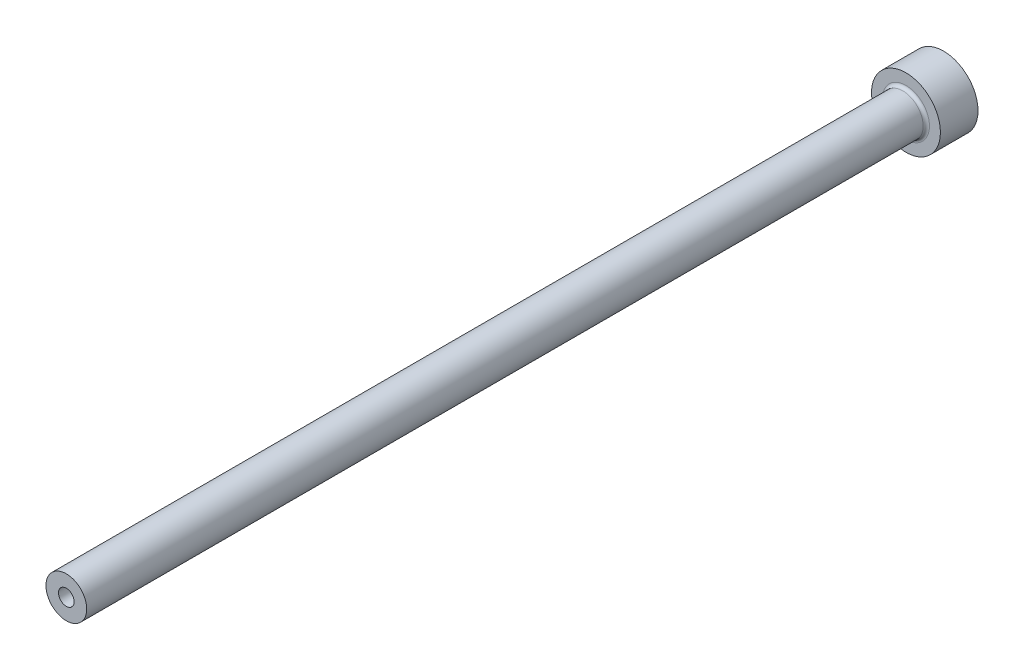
ISO-10303-21;
HEADER;
FILE_DESCRIPTION(('STEP AP214'),'2;1');
FILE_NAME('part.step','',(''),(''),'','','');
FILE_SCHEMA(('AUTOMOTIVE_DESIGN { 1 0 10303 214 1 1 1 1 }'));
ENDSEC;
DATA;
#1=APPLICATION_CONTEXT('core data for automotive mechanical design processes');
#2=APPLICATION_PROTOCOL_DEFINITION('international standard','automotive_design',2000,#1);
#3=PRODUCT_CONTEXT('',#1,'mechanical');
#4=PRODUCT('Part','Part','',(#3));
#5=PRODUCT_RELATED_PRODUCT_CATEGORY('part','',(#4));
#6=PRODUCT_DEFINITION_FORMATION('','',#4);
#7=PRODUCT_DEFINITION_CONTEXT('part definition',#1,'design');
#8=PRODUCT_DEFINITION('design','',#6,#7);
#9=PRODUCT_DEFINITION_SHAPE('','',#8);
#10=(LENGTH_UNIT() NAMED_UNIT(*) SI_UNIT(.MILLI.,.METRE.));
#11=(NAMED_UNIT(*) PLANE_ANGLE_UNIT() SI_UNIT($,.RADIAN.));
#12=(NAMED_UNIT(*) SI_UNIT($,.STERADIAN.) SOLID_ANGLE_UNIT());
#13=UNCERTAINTY_MEASURE_WITH_UNIT(LENGTH_MEASURE(1.E-05),#10,'distance_accuracy_value','');
#14=(GEOMETRIC_REPRESENTATION_CONTEXT(3) GLOBAL_UNCERTAINTY_ASSIGNED_CONTEXT((#13)) GLOBAL_UNIT_ASSIGNED_CONTEXT((#10,
#11,#12)) REPRESENTATION_CONTEXT('',''));
#15=CARTESIAN_POINT('',(0.,0.,0.));
#16=DIRECTION('',(0.,0.,1.));
#17=DIRECTION('',(1.,0.,0.));
#18=AXIS2_PLACEMENT_3D('',#15,#16,#17);
#19=CARTESIAN_POINT('',(0.,0.,140.));
#20=DIRECTION('',(0.,0.,-1.));
#21=DIRECTION('',(-1.,0.,0.));
#22=AXIS2_PLACEMENT_3D('',#19,#20,#21);
#23=PLANE('',#22);
#24=CARTESIAN_POINT('',(0.,0.,140.));
#25=DIRECTION('',(0.,0.,1.));
#26=DIRECTION('',(1.,0.,0.));
#27=AXIS2_PLACEMENT_3D('',#24,#25,#26);
#28=CIRCLE('',#27,1.24999999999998);
#29=CARTESIAN_POINT('',(1.24999999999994,0.,140.));
#30=VERTEX_POINT('',#29);
#31=EDGE_CURVE('E63',#30,#30,#28,.T.);
#32=ORIENTED_EDGE('',*,*,#31,.F.);
#33=EDGE_LOOP('',(#32));
#34=FACE_BOUND('',#33,.T.);
#35=CARTESIAN_POINT('',(0.,0.,140.));
#36=DIRECTION('',(0.,0.,1.));
#37=DIRECTION('',(1.,0.,0.));
#38=AXIS2_PLACEMENT_3D('',#35,#36,#37);
#39=CIRCLE('',#38,3.24999999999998);
#40=CARTESIAN_POINT('',(3.24999999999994,0.,140.));
#41=VERTEX_POINT('',#40);
#42=EDGE_CURVE('E54',#41,#41,#39,.T.);
#43=ORIENTED_EDGE('',*,*,#42,.T.);
#44=EDGE_LOOP('',(#43));
#45=FACE_BOUND('',#44,.T.);
#46=ADVANCED_FACE('F34',(#34,#45),#23,.F.);
#47=CARTESIAN_POINT('',(0.,0.,140.));
#48=DIRECTION('',(0.,0.,1.));
#49=DIRECTION('',(1.,0.,0.));
#50=AXIS2_PLACEMENT_3D('',#47,#48,#49);
#51=CYLINDRICAL_SURFACE('',#50,3.24999999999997);
#52=CARTESIAN_POINT('',(0.,0.,6.50000000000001));
#53=DIRECTION('',(0.,0.,1.));
#54=DIRECTION('',(1.,0.,0.));
#55=AXIS2_PLACEMENT_3D('',#52,#53,#54);
#56=CIRCLE('',#55,3.24999999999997);
#57=CARTESIAN_POINT('',(3.24999999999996,0.,6.50000000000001));
#58=VERTEX_POINT('',#57);
#59=EDGE_CURVE('E49',#58,#58,#56,.T.);
#60=ORIENTED_EDGE('',*,*,#59,.T.);
#61=EDGE_LOOP('',(#60));
#62=FACE_BOUND('',#61,.T.);
#63=ORIENTED_EDGE('',*,*,#42,.F.);
#64=EDGE_LOOP('',(#63));
#65=FACE_BOUND('',#64,.T.);
#66=ADVANCED_FACE('F92',(#62,#65),#51,.T.);
#67=CARTESIAN_POINT('',(0.,0.,6.));
#68=DIRECTION('',(0.,0.,1.));
#69=DIRECTION('',(1.,0.,0.));
#70=AXIS2_PLACEMENT_3D('',#67,#68,#69);
#71=PLANE('',#70);
#72=CARTESIAN_POINT('',(0.,0.,6.));
#73=DIRECTION('',(0.,0.,1.));
#74=DIRECTION('',(1.,0.,0.));
#75=AXIS2_PLACEMENT_3D('',#72,#73,#74);
#76=CIRCLE('',#75,3.74999999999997);
#77=CARTESIAN_POINT('',(3.74999999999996,0.,6.));
#78=VERTEX_POINT('',#77);
#79=EDGE_CURVE('E45',#78,#78,#76,.F.);
#80=ORIENTED_EDGE('',*,*,#79,.T.);
#81=EDGE_LOOP('',(#80));
#82=FACE_BOUND('',#81,.T.);
#83=CARTESIAN_POINT('',(0.,0.,6.00000000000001));
#84=DIRECTION('',(0.,0.,1.));
#85=DIRECTION('',(1.,0.,0.));
#86=AXIS2_PLACEMENT_3D('',#83,#84,#85);
#87=CIRCLE('',#86,5.49999999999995);
#88=CARTESIAN_POINT('',(5.49999999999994,0.,6.00000000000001));
#89=VERTEX_POINT('',#88);
#90=EDGE_CURVE('E57',#89,#89,#87,.T.);
#91=ORIENTED_EDGE('',*,*,#90,.T.);
#92=EDGE_LOOP('',(#91));
#93=FACE_BOUND('',#92,.T.);
#94=ADVANCED_FACE('F98',(#82,#93),#71,.T.);
#95=CARTESIAN_POINT('',(0.,0.,140.));
#96=DIRECTION('',(0.,0.,1.));
#97=DIRECTION('',(1.,0.,0.));
#98=AXIS2_PLACEMENT_3D('',#95,#96,#97);
#99=CYLINDRICAL_SURFACE('',#98,5.49999999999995);
#100=ORIENTED_EDGE('',*,*,#90,.F.);
#101=EDGE_LOOP('',(#100));
#102=FACE_BOUND('',#101,.T.);
#103=CARTESIAN_POINT('',(0.,0.,0.));
#104=DIRECTION('',(0.,0.,1.));
#105=DIRECTION('',(1.,0.,0.));
#106=AXIS2_PLACEMENT_3D('',#103,#104,#105);
#107=CIRCLE('',#106,5.49999999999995);
#108=CARTESIAN_POINT('',(5.49999999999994,0.,0.));
#109=VERTEX_POINT('',#108);
#110=EDGE_CURVE('E60',#109,#109,#107,.T.);
#111=ORIENTED_EDGE('',*,*,#110,.T.);
#112=EDGE_LOOP('',(#111));
#113=FACE_BOUND('',#112,.T.);
#114=ADVANCED_FACE('F89',(#102,#113),#99,.T.);
#115=CARTESIAN_POINT('',(0.,0.,0.));
#116=DIRECTION('',(0.,0.,1.));
#117=DIRECTION('',(1.,0.,0.));
#118=AXIS2_PLACEMENT_3D('',#115,#116,#117);
#119=PLANE('',#118);
#120=CARTESIAN_POINT('',(0.,0.,0.));
#121=DIRECTION('',(0.,0.,1.));
#122=DIRECTION('',(1.,0.,0.));
#123=AXIS2_PLACEMENT_3D('',#120,#121,#122);
#124=CIRCLE('',#123,1.99999999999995);
#125=CARTESIAN_POINT('',(1.99999999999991,0.,0.));
#126=VERTEX_POINT('',#125);
#127=EDGE_CURVE('E41',#126,#126,#124,.T.);
#128=ORIENTED_EDGE('',*,*,#127,.T.);
#129=EDGE_LOOP('',(#128));
#130=FACE_BOUND('',#129,.T.);
#131=ORIENTED_EDGE('',*,*,#110,.F.);
#132=EDGE_LOOP('',(#131));
#133=FACE_BOUND('',#132,.T.);
#134=ADVANCED_FACE('F83',(#130,#133),#119,.F.);
#135=CARTESIAN_POINT('',(0.,0.,140.));
#136=DIRECTION('',(0.,0.,1.));
#137=DIRECTION('',(1.,0.,0.));
#138=AXIS2_PLACEMENT_3D('',#135,#136,#137);
#139=CYLINDRICAL_SURFACE('',#138,1.24999999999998);
#140=ORIENTED_EDGE('',*,*,#31,.T.);
#141=EDGE_LOOP('',(#140));
#142=FACE_BOUND('',#141,.T.);
#143=CARTESIAN_POINT('',(0.,0.,90.));
#144=DIRECTION('',(0.,0.,1.));
#145=DIRECTION('',(1.,0.,0.));
#146=AXIS2_PLACEMENT_3D('',#143,#144,#145);
#147=CIRCLE('',#146,1.24999999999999);
#148=CARTESIAN_POINT('',(1.24999999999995,0.,90.));
#149=VERTEX_POINT('',#148);
#150=EDGE_CURVE('E66',#149,#149,#147,.T.);
#151=ORIENTED_EDGE('',*,*,#150,.F.);
#152=EDGE_LOOP('',(#151));
#153=FACE_BOUND('',#152,.T.);
#154=ADVANCED_FACE('F78',(#142,#153),#139,.F.);
#155=CARTESIAN_POINT('',(0.,0.,90.));
#156=DIRECTION('',(0.,0.,-1.));
#157=DIRECTION('',(-1.,0.,0.));
#158=AXIS2_PLACEMENT_3D('',#155,#156,#157);
#159=CONICAL_SURFACE('',#158,1.24999999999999,0.523598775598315);
#160=CARTESIAN_POINT('',(0.,0.,89.5669872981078));
#161=DIRECTION('',(0.,0.,1.));
#162=DIRECTION('',(1.,0.,0.));
#163=AXIS2_PLACEMENT_3D('',#160,#161,#162);
#164=CIRCLE('',#163,1.49999999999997);
#165=CARTESIAN_POINT('',(1.49999999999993,0.,89.5669872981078));
#166=VERTEX_POINT('',#165);
#167=EDGE_CURVE('E69',#166,#166,#164,.T.);
#168=ORIENTED_EDGE('',*,*,#167,.F.);
#169=EDGE_LOOP('',(#168));
#170=FACE_BOUND('',#169,.T.);
#171=ORIENTED_EDGE('',*,*,#150,.T.);
#172=EDGE_LOOP('',(#171));
#173=FACE_BOUND('',#172,.T.);
#174=ADVANCED_FACE('F75',(#170,#173),#159,.F.);
#175=CARTESIAN_POINT('',(0.,0.,140.));
#176=DIRECTION('',(0.,0.,1.));
#177=DIRECTION('',(1.,0.,0.));
#178=AXIS2_PLACEMENT_3D('',#175,#176,#177);
#179=CYLINDRICAL_SURFACE('',#178,1.49999999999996);
#180=CARTESIAN_POINT('',(0.,0.,0.499999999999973));
#181=DIRECTION('',(0.,0.,1.));
#182=DIRECTION('',(1.,0.,0.));
#183=AXIS2_PLACEMENT_3D('',#180,#181,#182);
#184=CIRCLE('',#183,1.49999999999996);
#185=CARTESIAN_POINT('',(1.49999999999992,0.,0.499999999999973));
#186=VERTEX_POINT('',#185);
#187=EDGE_CURVE('E10',#186,#186,#184,.F.);
#188=ORIENTED_EDGE('',*,*,#187,.T.);
#189=EDGE_LOOP('',(#188));
#190=FACE_BOUND('',#189,.T.);
#191=ORIENTED_EDGE('',*,*,#167,.T.);
#192=EDGE_LOOP('',(#191));
#193=FACE_BOUND('',#192,.T.);
#194=ADVANCED_FACE('F73',(#190,#193),#179,.F.);
#195=CARTESIAN_POINT('',(0.,0.,6.50000000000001));
#196=DIRECTION('',(0.,0.,1.));
#197=DIRECTION('',(1.,0.,0.));
#198=AXIS2_PLACEMENT_3D('',#195,#196,#197);
#199=TOROIDAL_SURFACE('',#198,3.74999999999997,0.5);
#200=ORIENTED_EDGE('',*,*,#79,.F.);
#201=EDGE_LOOP('',(#200));
#202=FACE_BOUND('',#201,.T.);
#203=ORIENTED_EDGE('',*,*,#59,.F.);
#204=EDGE_LOOP('',(#203));
#205=FACE_BOUND('',#204,.T.);
#206=ADVANCED_FACE('F104',(#202,#205),#199,.F.);
#207=CARTESIAN_POINT('',(0.,0.,0.));
#208=DIRECTION('',(0.,0.,-1.));
#209=DIRECTION('',(-1.,0.,0.));
#210=AXIS2_PLACEMENT_3D('',#207,#208,#209);
#211=CONICAL_SURFACE('',#210,1.99999999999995,0.78539816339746);
#212=ORIENTED_EDGE('',*,*,#187,.F.);
#213=EDGE_LOOP('',(#212));
#214=FACE_BOUND('',#213,.T.);
#215=ORIENTED_EDGE('',*,*,#127,.F.);
#216=EDGE_LOOP('',(#215));
#217=FACE_BOUND('',#216,.T.);
#218=ADVANCED_FACE('F36',(#214,#217),#211,.F.);
#219=CLOSED_SHELL('',(#46,#66,#94,#114,#134,#154,#174,#194,#206,#218));
#220=MANIFOLD_SOLID_BREP('B2',#219);
#221=ADVANCED_BREP_SHAPE_REPRESENTATION('',(#18,#220),#14);
#222=SHAPE_DEFINITION_REPRESENTATION(#9,#221);
ENDSEC;
END-ISO-10303-21;
